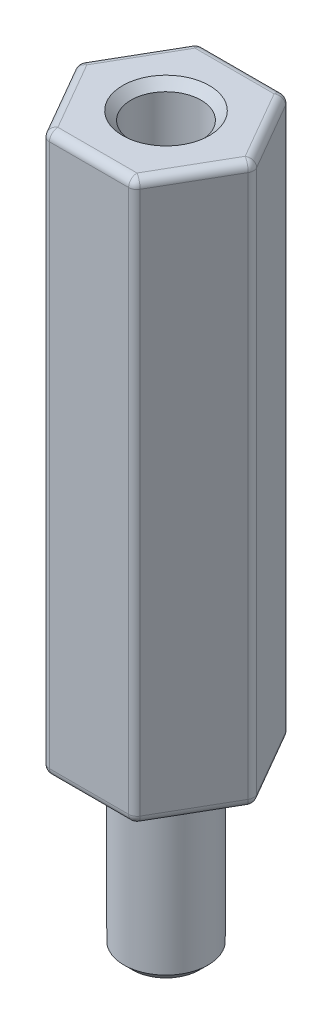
ISO-10303-21;
HEADER;
FILE_DESCRIPTION(('STEP AP214'),'2;1');
FILE_NAME('part.step','',(''),(''),'','','');
FILE_SCHEMA(('AUTOMOTIVE_DESIGN { 1 0 10303 214 1 1 1 1 }'));
ENDSEC;
DATA;
#1=APPLICATION_CONTEXT('core data for automotive mechanical design processes');
#2=APPLICATION_PROTOCOL_DEFINITION('international standard','automotive_design',2000,#1);
#3=PRODUCT_CONTEXT('',#1,'mechanical');
#4=PRODUCT('Part','Part','',(#3));
#5=PRODUCT_RELATED_PRODUCT_CATEGORY('part','',(#4));
#6=PRODUCT_DEFINITION_FORMATION('','',#4);
#7=PRODUCT_DEFINITION_CONTEXT('part definition',#1,'design');
#8=PRODUCT_DEFINITION('design','',#6,#7);
#9=PRODUCT_DEFINITION_SHAPE('','',#8);
#10=(LENGTH_UNIT() NAMED_UNIT(*) SI_UNIT(.MILLI.,.METRE.));
#11=(NAMED_UNIT(*) PLANE_ANGLE_UNIT() SI_UNIT($,.RADIAN.));
#12=(NAMED_UNIT(*) SI_UNIT($,.STERADIAN.) SOLID_ANGLE_UNIT());
#13=UNCERTAINTY_MEASURE_WITH_UNIT(LENGTH_MEASURE(1.E-05),#10,'distance_accuracy_value','');
#14=(GEOMETRIC_REPRESENTATION_CONTEXT(3) GLOBAL_UNCERTAINTY_ASSIGNED_CONTEXT((#13)) GLOBAL_UNIT_ASSIGNED_CONTEXT((#10,
#11,#12)) REPRESENTATION_CONTEXT('',''));
#15=CARTESIAN_POINT('',(0.,0.,0.));
#16=DIRECTION('',(0.,0.,1.));
#17=DIRECTION('',(1.,0.,0.));
#18=AXIS2_PLACEMENT_3D('',#15,#16,#17);
#19=CARTESIAN_POINT('',(0.,20.,0.));
#20=DIRECTION('',(0.,1.,0.));
#21=DIRECTION('',(0.,0.,1.));
#22=AXIS2_PLACEMENT_3D('',#19,#20,#21);
#23=PLANE('',#22);
#24=CARTESIAN_POINT('',(0.,20.,0.));
#25=DIRECTION('',(0.,1.,0.));
#26=DIRECTION('',(0.,0.,1.));
#27=AXIS2_PLACEMENT_3D('',#24,#25,#26);
#28=CIRCLE('',#27,1.55);
#29=CARTESIAN_POINT('',(0.,20.,1.55));
#30=VERTEX_POINT('',#29);
#31=EDGE_CURVE('E319',#30,#30,#28,.F.);
#32=ORIENTED_EDGE('',*,*,#31,.T.);
#33=EDGE_LOOP('',(#32));
#34=FACE_BOUND('',#33,.T.);
#35=DIRECTION('',(-0.5,0.,0.866025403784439));
#36=VECTOR('',#35,1.);
#37=CARTESIAN_POINT('',(-2.82901631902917,20.,0.));
#38=LINE('',#37,#36);
#39=CARTESIAN_POINT('',(-1.41450815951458,20.,-2.45));
#40=VERTEX_POINT('',#39);
#41=CARTESIAN_POINT('',(-2.82901631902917,20.,0.));
#42=VERTEX_POINT('',#41);
#43=EDGE_CURVE('E63',#40,#42,#38,.T.);
#44=ORIENTED_EDGE('',*,*,#43,.T.);
#45=DIRECTION('',(0.5,0.,0.866025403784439));
#46=VECTOR('',#45,1.);
#47=CARTESIAN_POINT('',(-1.41450815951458,20.,2.45));
#48=LINE('',#47,#46);
#49=CARTESIAN_POINT('',(-1.41450815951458,20.,2.45));
#50=VERTEX_POINT('',#49);
#51=EDGE_CURVE('E646',#42,#50,#48,.T.);
#52=ORIENTED_EDGE('',*,*,#51,.T.);
#53=DIRECTION('',(1.,0.,0.));
#54=VECTOR('',#53,1.);
#55=CARTESIAN_POINT('',(1.41450815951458,20.,2.45));
#56=LINE('',#55,#54);
#57=CARTESIAN_POINT('',(1.41450815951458,20.,2.45));
#58=VERTEX_POINT('',#57);
#59=EDGE_CURVE('E633',#50,#58,#56,.T.);
#60=ORIENTED_EDGE('',*,*,#59,.T.);
#61=DIRECTION('',(0.5,0.,-0.866025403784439));
#62=VECTOR('',#61,1.);
#63=CARTESIAN_POINT('',(2.82901631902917,20.,0.));
#64=LINE('',#63,#62);
#65=CARTESIAN_POINT('',(2.82901631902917,20.,0.));
#66=VERTEX_POINT('',#65);
#67=EDGE_CURVE('E636',#58,#66,#64,.T.);
#68=ORIENTED_EDGE('',*,*,#67,.T.);
#69=DIRECTION('',(-0.5,0.,-0.866025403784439));
#70=VECTOR('',#69,1.);
#71=CARTESIAN_POINT('',(1.41450815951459,20.,-2.45));
#72=LINE('',#71,#70);
#73=CARTESIAN_POINT('',(1.41450815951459,20.,-2.45));
#74=VERTEX_POINT('',#73);
#75=EDGE_CURVE('E639',#66,#74,#72,.T.);
#76=ORIENTED_EDGE('',*,*,#75,.T.);
#77=DIRECTION('',(-1.,0.,0.));
#78=VECTOR('',#77,1.);
#79=CARTESIAN_POINT('',(-1.41450815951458,20.,-2.45));
#80=LINE('',#79,#78);
#81=EDGE_CURVE('E68',#74,#40,#80,.T.);
#82=ORIENTED_EDGE('',*,*,#81,.T.);
#83=EDGE_LOOP('',(#44,#52,#60,#68,#76,#82));
#84=FACE_BOUND('',#83,.T.);
#85=ADVANCED_FACE('F47',(#34,#84),#23,.T.);
#86=CARTESIAN_POINT('',(0.,0.,0.));
#87=DIRECTION('',(0.,1.,0.));
#88=DIRECTION('',(0.,0.,1.));
#89=AXIS2_PLACEMENT_3D('',#86,#87,#88);
#90=PLANE('',#89);
#91=CARTESIAN_POINT('',(0.,0.,0.));
#92=DIRECTION('',(0.,1.,0.));
#93=DIRECTION('',(0.,0.,1.));
#94=AXIS2_PLACEMENT_3D('',#91,#92,#93);
#95=CIRCLE('',#94,1.8);
#96=CARTESIAN_POINT('',(0.,0.,1.8));
#97=VERTEX_POINT('',#96);
#98=EDGE_CURVE('E11',#97,#97,#95,.T.);
#99=ORIENTED_EDGE('',*,*,#98,.T.);
#100=EDGE_LOOP('',(#99));
#101=FACE_BOUND('',#100,.T.);
#102=DIRECTION('',(1.,0.,0.));
#103=VECTOR('',#102,1.);
#104=CARTESIAN_POINT('',(0.,0.,2.45));
#105=LINE('',#104,#103);
#106=CARTESIAN_POINT('',(1.41450815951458,0.,2.45));
#107=VERTEX_POINT('',#106);
#108=CARTESIAN_POINT('',(-1.41450815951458,0.,2.45));
#109=VERTEX_POINT('',#108);
#110=EDGE_CURVE('E184',#107,#109,#105,.F.);
#111=ORIENTED_EDGE('',*,*,#110,.T.);
#112=DIRECTION('',(0.5,0.,0.866025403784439));
#113=VECTOR('',#112,1.);
#114=CARTESIAN_POINT('',(-2.12176223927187,0.,1.225));
#115=LINE('',#114,#113);
#116=CARTESIAN_POINT('',(-2.82901631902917,0.,0.));
#117=VERTEX_POINT('',#116);
#118=EDGE_CURVE('E212',#109,#117,#115,.F.);
#119=ORIENTED_EDGE('',*,*,#118,.T.);
#120=DIRECTION('',(-0.5,0.,0.866025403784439));
#121=VECTOR('',#120,1.);
#122=CARTESIAN_POINT('',(-2.12176223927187,0.,-1.225));
#123=LINE('',#122,#121);
#124=CARTESIAN_POINT('',(-1.41450815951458,0.,-2.45));
#125=VERTEX_POINT('',#124);
#126=EDGE_CURVE('E574',#117,#125,#123,.F.);
#127=ORIENTED_EDGE('',*,*,#126,.T.);
#128=DIRECTION('',(-1.,0.,0.));
#129=VECTOR('',#128,1.);
#130=CARTESIAN_POINT('',(0.,0.,-2.45));
#131=LINE('',#130,#129);
#132=CARTESIAN_POINT('',(1.41450815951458,0.,-2.45));
#133=VERTEX_POINT('',#132);
#134=EDGE_CURVE('E571',#125,#133,#131,.F.);
#135=ORIENTED_EDGE('',*,*,#134,.T.);
#136=DIRECTION('',(-0.5,0.,-0.866025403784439));
#137=VECTOR('',#136,1.);
#138=CARTESIAN_POINT('',(2.12176223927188,0.,-1.225));
#139=LINE('',#138,#137);
#140=CARTESIAN_POINT('',(2.82901631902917,0.,0.));
#141=VERTEX_POINT('',#140);
#142=EDGE_CURVE('E568',#133,#141,#139,.F.);
#143=ORIENTED_EDGE('',*,*,#142,.T.);
#144=DIRECTION('',(0.5,0.,-0.866025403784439));
#145=VECTOR('',#144,1.);
#146=CARTESIAN_POINT('',(2.12176223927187,0.,1.225));
#147=LINE('',#146,#145);
#148=EDGE_CURVE('E565',#141,#107,#147,.F.);
#149=ORIENTED_EDGE('',*,*,#148,.T.);
#150=EDGE_LOOP('',(#111,#119,#127,#135,#143,#149));
#151=FACE_BOUND('',#150,.T.);
#152=ADVANCED_FACE('F339',(#101,#151),#90,.F.);
#153=CARTESIAN_POINT('',(1.58771324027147,20.,-2.75));
#154=DIRECTION('',(0.,0.,1.));
#155=DIRECTION('',(1.,0.,0.));
#156=AXIS2_PLACEMENT_3D('',#153,#154,#155);
#157=PLANE('',#156);
#158=DIRECTION('',(0.,-1.,0.));
#159=VECTOR('',#158,1.);
#160=CARTESIAN_POINT('',(1.41450815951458,20.,-2.75));
#161=LINE('',#160,#159);
#162=CARTESIAN_POINT('',(1.41450815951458,19.7,-2.75));
#163=VERTEX_POINT('',#162);
#164=CARTESIAN_POINT('',(1.41450815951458,0.300000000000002,-2.75));
#165=VERTEX_POINT('',#164);
#166=EDGE_CURVE('E521',#163,#165,#161,.T.);
#167=ORIENTED_EDGE('',*,*,#166,.T.);
#168=DIRECTION('',(-1.,0.,0.));
#169=VECTOR('',#168,1.);
#170=CARTESIAN_POINT('',(1.58771324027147,0.300000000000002,-2.75));
#171=LINE('',#170,#169);
#172=CARTESIAN_POINT('',(-1.41450815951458,0.300000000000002,-2.75));
#173=VERTEX_POINT('',#172);
#174=EDGE_CURVE('E600',#165,#173,#171,.T.);
#175=ORIENTED_EDGE('',*,*,#174,.T.);
#176=DIRECTION('',(0.,-1.,0.));
#177=VECTOR('',#176,1.);
#178=CARTESIAN_POINT('',(-1.41450815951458,20.,-2.75));
#179=LINE('',#178,#177);
#180=CARTESIAN_POINT('',(-1.41450815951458,19.7,-2.75));
#181=VERTEX_POINT('',#180);
#182=EDGE_CURVE('E517',#173,#181,#179,.F.);
#183=ORIENTED_EDGE('',*,*,#182,.T.);
#184=DIRECTION('',(-1.,0.,0.));
#185=VECTOR('',#184,1.);
#186=CARTESIAN_POINT('',(1.41450815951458,19.7,-2.75));
#187=LINE('',#186,#185);
#188=EDGE_CURVE('E597',#181,#163,#187,.F.);
#189=ORIENTED_EDGE('',*,*,#188,.T.);
#190=EDGE_LOOP('',(#167,#175,#183,#189));
#191=FACE_BOUND('',#190,.T.);
#192=ADVANCED_FACE('F345',(#191),#157,.F.);
#193=CARTESIAN_POINT('',(-1.58771324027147,20.,-2.75));
#194=DIRECTION('',(0.866025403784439,0.,0.5));
#195=DIRECTION('',(0.5,0.,-0.866025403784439));
#196=AXIS2_PLACEMENT_3D('',#193,#194,#195);
#197=PLANE('',#196);
#198=DIRECTION('',(0.,-1.,0.));
#199=VECTOR('',#198,1.);
#200=CARTESIAN_POINT('',(-1.67431578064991,20.,-2.6));
#201=LINE('',#200,#199);
#202=CARTESIAN_POINT('',(-1.67431578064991,19.7,-2.6));
#203=VERTEX_POINT('',#202);
#204=CARTESIAN_POINT('',(-1.67431578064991,0.300000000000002,-2.6));
#205=VERTEX_POINT('',#204);
#206=EDGE_CURVE('E198',#203,#205,#201,.T.);
#207=ORIENTED_EDGE('',*,*,#206,.T.);
#208=DIRECTION('',(-0.5,0.,0.866025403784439));
#209=VECTOR('',#208,1.);
#210=CARTESIAN_POINT('',(-1.58771324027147,0.300000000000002,-2.75));
#211=LINE('',#210,#209);
#212=CARTESIAN_POINT('',(-3.0888239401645,0.300000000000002,-0.15));
#213=VERTEX_POINT('',#212);
#214=EDGE_CURVE('E588',#205,#213,#211,.T.);
#215=ORIENTED_EDGE('',*,*,#214,.T.);
#216=DIRECTION('',(0.,-1.,0.));
#217=VECTOR('',#216,1.);
#218=CARTESIAN_POINT('',(-3.0888239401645,20.,-0.15));
#219=LINE('',#218,#217);
#220=CARTESIAN_POINT('',(-3.0888239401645,19.7,-0.15));
#221=VERTEX_POINT('',#220);
#222=EDGE_CURVE('E543',#213,#221,#219,.F.);
#223=ORIENTED_EDGE('',*,*,#222,.T.);
#224=DIRECTION('',(-0.5,0.,0.866025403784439));
#225=VECTOR('',#224,1.);
#226=CARTESIAN_POINT('',(-1.67431578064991,19.7,-2.6));
#227=LINE('',#226,#225);
#228=EDGE_CURVE('E585',#221,#203,#227,.F.);
#229=ORIENTED_EDGE('',*,*,#228,.T.);
#230=EDGE_LOOP('',(#207,#215,#223,#229));
#231=FACE_BOUND('',#230,.T.);
#232=ADVANCED_FACE('F366',(#231),#197,.F.);
#233=CARTESIAN_POINT('',(-3.17542648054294,20.,0.));
#234=DIRECTION('',(0.866025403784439,0.,-0.5));
#235=DIRECTION('',(-0.5,0.,-0.866025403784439));
#236=AXIS2_PLACEMENT_3D('',#233,#234,#235);
#237=PLANE('',#236);
#238=DIRECTION('',(0.,-1.,0.));
#239=VECTOR('',#238,1.);
#240=CARTESIAN_POINT('',(-3.0888239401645,20.,0.149999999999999));
#241=LINE('',#240,#239);
#242=CARTESIAN_POINT('',(-3.0888239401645,19.7,0.149999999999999));
#243=VERTEX_POINT('',#242);
#244=CARTESIAN_POINT('',(-3.0888239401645,0.300000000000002,0.149999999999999));
#245=VERTEX_POINT('',#244);
#246=EDGE_CURVE('E179',#243,#245,#241,.T.);
#247=ORIENTED_EDGE('',*,*,#246,.T.);
#248=DIRECTION('',(0.5,0.,0.866025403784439));
#249=VECTOR('',#248,1.);
#250=CARTESIAN_POINT('',(-3.17542648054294,0.300000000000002,0.));
#251=LINE('',#250,#249);
#252=CARTESIAN_POINT('',(-1.67431578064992,0.300000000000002,2.6));
#253=VERTEX_POINT('',#252);
#254=EDGE_CURVE('E174',#245,#253,#251,.T.);
#255=ORIENTED_EDGE('',*,*,#254,.T.);
#256=DIRECTION('',(0.,-1.,0.));
#257=VECTOR('',#256,1.);
#258=CARTESIAN_POINT('',(-1.67431578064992,20.,2.6));
#259=LINE('',#258,#257);
#260=CARTESIAN_POINT('',(-1.67431578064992,19.7,2.6));
#261=VERTEX_POINT('',#260);
#262=EDGE_CURVE('E177',#253,#261,#259,.F.);
#263=ORIENTED_EDGE('',*,*,#262,.T.);
#264=DIRECTION('',(0.5,0.,0.866025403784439));
#265=VECTOR('',#264,1.);
#266=CARTESIAN_POINT('',(-3.0888239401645,19.7,0.149999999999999));
#267=LINE('',#266,#265);
#268=EDGE_CURVE('E185',#261,#243,#267,.F.);
#269=ORIENTED_EDGE('',*,*,#268,.T.);
#270=EDGE_LOOP('',(#247,#255,#263,#269));
#271=FACE_BOUND('',#270,.T.);
#272=ADVANCED_FACE('F176',(#271),#237,.F.);
#273=CARTESIAN_POINT('',(-1.58771324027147,20.,2.75));
#274=DIRECTION('',(0.,0.,-1.));
#275=DIRECTION('',(-1.,0.,0.));
#276=AXIS2_PLACEMENT_3D('',#273,#274,#275);
#277=PLANE('',#276);
#278=DIRECTION('',(0.,-1.,0.));
#279=VECTOR('',#278,1.);
#280=CARTESIAN_POINT('',(-1.41450815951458,20.,2.75));
#281=LINE('',#280,#279);
#282=CARTESIAN_POINT('',(-1.41450815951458,19.7,2.75));
#283=VERTEX_POINT('',#282);
#284=CARTESIAN_POINT('',(-1.41450815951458,0.300000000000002,2.75));
#285=VERTEX_POINT('',#284);
#286=EDGE_CURVE('E556',#283,#285,#281,.T.);
#287=ORIENTED_EDGE('',*,*,#286,.T.);
#288=DIRECTION('',(1.,0.,0.));
#289=VECTOR('',#288,1.);
#290=CARTESIAN_POINT('',(-1.58771324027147,0.300000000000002,2.75));
#291=LINE('',#290,#289);
#292=CARTESIAN_POINT('',(1.41450815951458,0.300000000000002,2.75));
#293=VERTEX_POINT('',#292);
#294=EDGE_CURVE('E224',#285,#293,#291,.T.);
#295=ORIENTED_EDGE('',*,*,#294,.T.);
#296=DIRECTION('',(0.,-1.,0.));
#297=VECTOR('',#296,1.);
#298=CARTESIAN_POINT('',(1.41450815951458,20.,2.75));
#299=LINE('',#298,#297);
#300=CARTESIAN_POINT('',(1.41450815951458,19.7,2.75));
#301=VERTEX_POINT('',#300);
#302=EDGE_CURVE('E552',#293,#301,#299,.F.);
#303=ORIENTED_EDGE('',*,*,#302,.T.);
#304=DIRECTION('',(1.,0.,0.));
#305=VECTOR('',#304,1.);
#306=CARTESIAN_POINT('',(-1.41450815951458,19.7,2.75));
#307=LINE('',#306,#305);
#308=EDGE_CURVE('E648',#301,#283,#307,.F.);
#309=ORIENTED_EDGE('',*,*,#308,.T.);
#310=EDGE_LOOP('',(#287,#295,#303,#309));
#311=FACE_BOUND('',#310,.T.);
#312=ADVANCED_FACE('F359',(#311),#277,.F.);
#313=CARTESIAN_POINT('',(1.58771324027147,20.,2.75));
#314=DIRECTION('',(-0.866025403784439,0.,-0.5));
#315=DIRECTION('',(-0.5,0.,0.866025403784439));
#316=AXIS2_PLACEMENT_3D('',#313,#314,#315);
#317=PLANE('',#316);
#318=DIRECTION('',(0.,-1.,0.));
#319=VECTOR('',#318,1.);
#320=CARTESIAN_POINT('',(1.67431578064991,20.,2.6));
#321=LINE('',#320,#319);
#322=CARTESIAN_POINT('',(1.67431578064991,19.7,2.6));
#323=VERTEX_POINT('',#322);
#324=CARTESIAN_POINT('',(1.67431578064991,0.300000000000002,2.6));
#325=VERTEX_POINT('',#324);
#326=EDGE_CURVE('E535',#323,#325,#321,.T.);
#327=ORIENTED_EDGE('',*,*,#326,.T.);
#328=DIRECTION('',(0.5,0.,-0.866025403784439));
#329=VECTOR('',#328,1.);
#330=CARTESIAN_POINT('',(1.58771324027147,0.300000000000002,2.75));
#331=LINE('',#330,#329);
#332=CARTESIAN_POINT('',(3.0888239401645,0.300000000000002,0.149999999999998));
#333=VERTEX_POINT('',#332);
#334=EDGE_CURVE('E624',#325,#333,#331,.T.);
#335=ORIENTED_EDGE('',*,*,#334,.T.);
#336=DIRECTION('',(0.,-1.,0.));
#337=VECTOR('',#336,1.);
#338=CARTESIAN_POINT('',(3.0888239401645,20.,0.149999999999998));
#339=LINE('',#338,#337);
#340=CARTESIAN_POINT('',(3.0888239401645,19.7,0.149999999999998));
#341=VERTEX_POINT('',#340);
#342=EDGE_CURVE('E539',#333,#341,#339,.F.);
#343=ORIENTED_EDGE('',*,*,#342,.T.);
#344=DIRECTION('',(0.5,0.,-0.866025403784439));
#345=VECTOR('',#344,1.);
#346=CARTESIAN_POINT('',(1.67431578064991,19.7,2.6));
#347=LINE('',#346,#345);
#348=EDGE_CURVE('E621',#341,#323,#347,.F.);
#349=ORIENTED_EDGE('',*,*,#348,.T.);
#350=EDGE_LOOP('',(#327,#335,#343,#349));
#351=FACE_BOUND('',#350,.T.);
#352=ADVANCED_FACE('F355',(#351),#317,.F.);
#353=CARTESIAN_POINT('',(3.17542648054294,20.,0.));
#354=DIRECTION('',(-0.866025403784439,0.,0.5));
#355=DIRECTION('',(0.5,0.,0.866025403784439));
#356=AXIS2_PLACEMENT_3D('',#353,#354,#355);
#357=PLANE('',#356);
#358=DIRECTION('',(0.,-1.,0.));
#359=VECTOR('',#358,1.);
#360=CARTESIAN_POINT('',(3.0888239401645,20.,-0.150000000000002));
#361=LINE('',#360,#359);
#362=CARTESIAN_POINT('',(3.0888239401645,19.7,-0.150000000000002));
#363=VERTEX_POINT('',#362);
#364=CARTESIAN_POINT('',(3.0888239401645,0.300000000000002,-0.150000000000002));
#365=VERTEX_POINT('',#364);
#366=EDGE_CURVE('E527',#363,#365,#361,.T.);
#367=ORIENTED_EDGE('',*,*,#366,.T.);
#368=DIRECTION('',(-0.5,0.,-0.866025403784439));
#369=VECTOR('',#368,1.);
#370=CARTESIAN_POINT('',(3.17542648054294,0.300000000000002,0.));
#371=LINE('',#370,#369);
#372=CARTESIAN_POINT('',(1.67431578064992,0.300000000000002,-2.6));
#373=VERTEX_POINT('',#372);
#374=EDGE_CURVE('E612',#365,#373,#371,.T.);
#375=ORIENTED_EDGE('',*,*,#374,.T.);
#376=DIRECTION('',(0.,-1.,0.));
#377=VECTOR('',#376,1.);
#378=CARTESIAN_POINT('',(1.67431578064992,20.,-2.6));
#379=LINE('',#378,#377);
#380=CARTESIAN_POINT('',(1.67431578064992,19.7,-2.6));
#381=VERTEX_POINT('',#380);
#382=EDGE_CURVE('E531',#373,#381,#379,.F.);
#383=ORIENTED_EDGE('',*,*,#382,.T.);
#384=DIRECTION('',(-0.5,0.,-0.866025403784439));
#385=VECTOR('',#384,1.);
#386=CARTESIAN_POINT('',(3.0888239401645,19.7,-0.150000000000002));
#387=LINE('',#386,#385);
#388=EDGE_CURVE('E609',#381,#363,#387,.F.);
#389=ORIENTED_EDGE('',*,*,#388,.T.);
#390=EDGE_LOOP('',(#367,#375,#383,#389));
#391=FACE_BOUND('',#390,.T.);
#392=ADVANCED_FACE('F352',(#391),#357,.F.);
#393=CARTESIAN_POINT('',(0.,20.,0.));
#394=DIRECTION('',(0.,-1.,0.));
#395=DIRECTION('',(0.,0.,-1.));
#396=AXIS2_PLACEMENT_3D('',#393,#394,#395);
#397=CYLINDRICAL_SURFACE('',#396,1.25);
#398=CARTESIAN_POINT('',(0.,19.7,0.));
#399=DIRECTION('',(0.,1.,0.));
#400=DIRECTION('',(0.,0.,1.));
#401=AXIS2_PLACEMENT_3D('',#398,#399,#400);
#402=CIRCLE('',#401,1.25);
#403=CARTESIAN_POINT('',(0.,19.7,1.25));
#404=VERTEX_POINT('',#403);
#405=EDGE_CURVE('E315',#404,#404,#402,.T.);
#406=ORIENTED_EDGE('',*,*,#405,.T.);
#407=EDGE_LOOP('',(#406));
#408=FACE_BOUND('',#407,.T.);
#409=CARTESIAN_POINT('',(0.,0.,0.));
#410=DIRECTION('',(0.,1.,0.));
#411=DIRECTION('',(0.,0.,1.));
#412=AXIS2_PLACEMENT_3D('',#409,#410,#411);
#413=CIRCLE('',#412,1.25);
#414=CARTESIAN_POINT('',(0.,0.,1.25));
#415=VERTEX_POINT('',#414);
#416=EDGE_CURVE('E265',#415,#415,#413,.T.);
#417=ORIENTED_EDGE('',*,*,#416,.F.);
#418=EDGE_LOOP('',(#417));
#419=FACE_BOUND('',#418,.T.);
#420=ADVANCED_FACE('F349',(#408,#419),#397,.F.);
#421=CARTESIAN_POINT('',(1.41450815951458,20.,-2.45));
#422=DIRECTION('',(0.,-1.,0.));
#423=DIRECTION('',(0.,0.,-1.));
#424=AXIS2_PLACEMENT_3D('',#421,#422,#423);
#425=CYLINDRICAL_SURFACE('',#424,0.3);
#426=ORIENTED_EDGE('',*,*,#382,.F.);
#427=CARTESIAN_POINT('',(1.41450815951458,0.300000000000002,-2.45));
#428=DIRECTION('',(0.,-1.,0.));
#429=DIRECTION('',(0.,0.,-1.));
#430=AXIS2_PLACEMENT_3D('',#427,#428,#429);
#431=CIRCLE('',#430,0.3);
#432=EDGE_CURVE('E606',#373,#165,#431,.F.);
#433=ORIENTED_EDGE('',*,*,#432,.T.);
#434=ORIENTED_EDGE('',*,*,#166,.F.);
#435=CARTESIAN_POINT('',(1.41450815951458,19.7,-2.45));
#436=DIRECTION('',(0.,-1.,0.));
#437=DIRECTION('',(0.,0.,-1.));
#438=AXIS2_PLACEMENT_3D('',#435,#436,#437);
#439=CIRCLE('',#438,0.3);
#440=EDGE_CURVE('E603',#163,#381,#439,.T.);
#441=ORIENTED_EDGE('',*,*,#440,.T.);
#442=EDGE_LOOP('',(#426,#433,#434,#441));
#443=FACE_BOUND('',#442,.T.);
#444=ADVANCED_FACE('F373',(#443),#425,.T.);
#445=CARTESIAN_POINT('',(2.82901631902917,20.,0.));
#446=DIRECTION('',(0.,-1.,0.));
#447=DIRECTION('',(0.,0.,-1.));
#448=AXIS2_PLACEMENT_3D('',#445,#446,#447);
#449=CYLINDRICAL_SURFACE('',#448,0.3);
#450=ORIENTED_EDGE('',*,*,#342,.F.);
#451=CARTESIAN_POINT('',(2.82901631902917,0.300000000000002,0.));
#452=DIRECTION('',(0.,-1.,0.));
#453=DIRECTION('',(0.,0.,-1.));
#454=AXIS2_PLACEMENT_3D('',#451,#452,#453);
#455=CIRCLE('',#454,0.3);
#456=EDGE_CURVE('E618',#333,#365,#455,.F.);
#457=ORIENTED_EDGE('',*,*,#456,.T.);
#458=ORIENTED_EDGE('',*,*,#366,.F.);
#459=CARTESIAN_POINT('',(2.82901631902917,19.7,0.));
#460=DIRECTION('',(0.,-1.,0.));
#461=DIRECTION('',(0.,0.,-1.));
#462=AXIS2_PLACEMENT_3D('',#459,#460,#461);
#463=CIRCLE('',#462,0.3);
#464=EDGE_CURVE('E615',#363,#341,#463,.T.);
#465=ORIENTED_EDGE('',*,*,#464,.T.);
#466=EDGE_LOOP('',(#450,#457,#458,#465));
#467=FACE_BOUND('',#466,.T.);
#468=ADVANCED_FACE('F376',(#467),#449,.T.);
#469=CARTESIAN_POINT('',(-1.41450815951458,20.,-2.45));
#470=DIRECTION('',(0.,-1.,0.));
#471=DIRECTION('',(0.,0.,-1.));
#472=AXIS2_PLACEMENT_3D('',#469,#470,#471);
#473=CYLINDRICAL_SURFACE('',#472,0.3);
#474=ORIENTED_EDGE('',*,*,#182,.F.);
#475=CARTESIAN_POINT('',(-1.41450815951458,0.300000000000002,-2.45));
#476=DIRECTION('',(0.,-1.,0.));
#477=DIRECTION('',(0.,0.,-1.));
#478=AXIS2_PLACEMENT_3D('',#475,#476,#477);
#479=CIRCLE('',#478,0.3);
#480=EDGE_CURVE('E594',#173,#205,#479,.F.);
#481=ORIENTED_EDGE('',*,*,#480,.T.);
#482=ORIENTED_EDGE('',*,*,#206,.F.);
#483=CARTESIAN_POINT('',(-1.41450815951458,19.7,-2.45));
#484=DIRECTION('',(0.,-1.,0.));
#485=DIRECTION('',(0.,0.,-1.));
#486=AXIS2_PLACEMENT_3D('',#483,#484,#485);
#487=CIRCLE('',#486,0.3);
#488=EDGE_CURVE('E591',#203,#181,#487,.T.);
#489=ORIENTED_EDGE('',*,*,#488,.T.);
#490=EDGE_LOOP('',(#474,#481,#482,#489));
#491=FACE_BOUND('',#490,.T.);
#492=ADVANCED_FACE('F380',(#491),#473,.T.);
#493=CARTESIAN_POINT('',(-2.82901631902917,20.,0.));
#494=DIRECTION('',(0.,-1.,0.));
#495=DIRECTION('',(0.,0.,-1.));
#496=AXIS2_PLACEMENT_3D('',#493,#494,#495);
#497=CYLINDRICAL_SURFACE('',#496,0.3);
#498=ORIENTED_EDGE('',*,*,#222,.F.);
#499=CARTESIAN_POINT('',(-2.82901631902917,0.300000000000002,0.));
#500=DIRECTION('',(0.,-1.,0.));
#501=DIRECTION('',(0.,0.,-1.));
#502=AXIS2_PLACEMENT_3D('',#499,#500,#501);
#503=CIRCLE('',#502,0.3);
#504=EDGE_CURVE('E582',#213,#245,#503,.F.);
#505=ORIENTED_EDGE('',*,*,#504,.T.);
#506=ORIENTED_EDGE('',*,*,#246,.F.);
#507=CARTESIAN_POINT('',(-2.82901631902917,19.7,0.));
#508=DIRECTION('',(0.,-1.,0.));
#509=DIRECTION('',(0.,0.,-1.));
#510=AXIS2_PLACEMENT_3D('',#507,#508,#509);
#511=CIRCLE('',#510,0.3);
#512=EDGE_CURVE('E579',#243,#221,#511,.T.);
#513=ORIENTED_EDGE('',*,*,#512,.T.);
#514=EDGE_LOOP('',(#498,#505,#506,#513));
#515=FACE_BOUND('',#514,.T.);
#516=ADVANCED_FACE('F384',(#515),#497,.T.);
#517=CARTESIAN_POINT('',(-1.41450815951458,20.,2.45));
#518=DIRECTION('',(0.,-1.,0.));
#519=DIRECTION('',(0.,0.,-1.));
#520=AXIS2_PLACEMENT_3D('',#517,#518,#519);
#521=CYLINDRICAL_SURFACE('',#520,0.3);
#522=ORIENTED_EDGE('',*,*,#262,.F.);
#523=CARTESIAN_POINT('',(-1.41450815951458,0.300000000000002,2.45));
#524=DIRECTION('',(0.,-1.,0.));
#525=DIRECTION('',(0.,0.,-1.));
#526=AXIS2_PLACEMENT_3D('',#523,#524,#525);
#527=CIRCLE('',#526,0.3);
#528=EDGE_CURVE('E193',#253,#285,#527,.F.);
#529=ORIENTED_EDGE('',*,*,#528,.T.);
#530=ORIENTED_EDGE('',*,*,#286,.F.);
#531=CARTESIAN_POINT('',(-1.41450815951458,19.7,2.45));
#532=DIRECTION('',(0.,-1.,0.));
#533=DIRECTION('',(0.,0.,-1.));
#534=AXIS2_PLACEMENT_3D('',#531,#532,#533);
#535=CIRCLE('',#534,0.3);
#536=EDGE_CURVE('E196',#283,#261,#535,.T.);
#537=ORIENTED_EDGE('',*,*,#536,.T.);
#538=EDGE_LOOP('',(#522,#529,#530,#537));
#539=FACE_BOUND('',#538,.T.);
#540=ADVANCED_FACE('F191',(#539),#521,.T.);
#541=CARTESIAN_POINT('',(1.41450815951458,20.,2.45));
#542=DIRECTION('',(0.,-1.,0.));
#543=DIRECTION('',(0.,0.,-1.));
#544=AXIS2_PLACEMENT_3D('',#541,#542,#543);
#545=CYLINDRICAL_SURFACE('',#544,0.3);
#546=ORIENTED_EDGE('',*,*,#302,.F.);
#547=CARTESIAN_POINT('',(1.41450815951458,0.300000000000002,2.45));
#548=DIRECTION('',(0.,-1.,0.));
#549=DIRECTION('',(0.,0.,-1.));
#550=AXIS2_PLACEMENT_3D('',#547,#548,#549);
#551=CIRCLE('',#550,0.3);
#552=EDGE_CURVE('E630',#293,#325,#551,.F.);
#553=ORIENTED_EDGE('',*,*,#552,.T.);
#554=ORIENTED_EDGE('',*,*,#326,.F.);
#555=CARTESIAN_POINT('',(1.41450815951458,19.7,2.45));
#556=DIRECTION('',(0.,-1.,0.));
#557=DIRECTION('',(0.,0.,-1.));
#558=AXIS2_PLACEMENT_3D('',#555,#556,#557);
#559=CIRCLE('',#558,0.3);
#560=EDGE_CURVE('E627',#323,#301,#559,.T.);
#561=ORIENTED_EDGE('',*,*,#560,.T.);
#562=EDGE_LOOP('',(#546,#553,#554,#561));
#563=FACE_BOUND('',#562,.T.);
#564=ADVANCED_FACE('F391',(#563),#545,.T.);
#565=CARTESIAN_POINT('',(1.41450815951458,0.300000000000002,-2.45));
#566=DIRECTION('',(0.,1.,0.));
#567=DIRECTION('',(0.,0.,1.));
#568=AXIS2_PLACEMENT_3D('',#565,#566,#567);
#569=SPHERICAL_SURFACE('',#568,0.3);
#570=CARTESIAN_POINT('',(1.41450815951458,0.300000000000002,-2.45));
#571=DIRECTION('',(-1.,0.,0.));
#572=DIRECTION('',(0.,0.,1.));
#573=AXIS2_PLACEMENT_3D('',#570,#571,#572);
#574=CIRCLE('',#573,0.3);
#575=EDGE_CURVE('E257',#165,#133,#574,.T.);
#576=ORIENTED_EDGE('',*,*,#575,.F.);
#577=ORIENTED_EDGE('',*,*,#432,.F.);
#578=CARTESIAN_POINT('',(1.41450815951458,0.300000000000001,-2.45));
#579=DIRECTION('',(0.499999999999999,0.,0.866025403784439));
#580=DIRECTION('',(0.866025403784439,0.,-0.499999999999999));
#581=AXIS2_PLACEMENT_3D('',#578,#579,#580);
#582=CIRCLE('',#581,0.3);
#583=EDGE_CURVE('E261',#133,#373,#582,.T.);
#584=ORIENTED_EDGE('',*,*,#583,.F.);
#585=EDGE_LOOP('',(#576,#577,#584));
#586=FACE_BOUND('',#585,.T.);
#587=ADVANCED_FACE('F394',(#586),#569,.T.);
#588=CARTESIAN_POINT('',(2.91561885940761,0.300000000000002,0.149999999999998));
#589=DIRECTION('',(-0.5,0.,-0.866025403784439));
#590=DIRECTION('',(-0.866025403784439,0.,0.5));
#591=AXIS2_PLACEMENT_3D('',#588,#589,#590);
#592=CYLINDRICAL_SURFACE('',#591,0.3);
#593=ORIENTED_EDGE('',*,*,#583,.T.);
#594=ORIENTED_EDGE('',*,*,#374,.F.);
#595=CARTESIAN_POINT('',(2.82901631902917,0.3,0.));
#596=DIRECTION('',(0.5,0.,0.866025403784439));
#597=DIRECTION('',(0.866025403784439,0.,-0.5));
#598=AXIS2_PLACEMENT_3D('',#595,#596,#597);
#599=CIRCLE('',#598,0.3);
#600=EDGE_CURVE('E253',#141,#365,#599,.T.);
#601=ORIENTED_EDGE('',*,*,#600,.F.);
#602=ORIENTED_EDGE('',*,*,#142,.F.);
#603=EDGE_LOOP('',(#593,#594,#601,#602));
#604=FACE_BOUND('',#603,.T.);
#605=ADVANCED_FACE('F432',(#604),#592,.T.);
#606=CARTESIAN_POINT('',(1.58771324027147,0.300000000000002,-2.45));
#607=DIRECTION('',(-1.,0.,0.));
#608=DIRECTION('',(0.,0.,1.));
#609=AXIS2_PLACEMENT_3D('',#606,#607,#608);
#610=CYLINDRICAL_SURFACE('',#609,0.3);
#611=ORIENTED_EDGE('',*,*,#575,.T.);
#612=ORIENTED_EDGE('',*,*,#134,.F.);
#613=CARTESIAN_POINT('',(-1.41450815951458,0.300000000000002,-2.45));
#614=DIRECTION('',(-1.,0.,0.));
#615=DIRECTION('',(0.,-1.,0.));
#616=AXIS2_PLACEMENT_3D('',#613,#614,#615);
#617=CIRCLE('',#616,0.3);
#618=EDGE_CURVE('E249',#173,#125,#617,.T.);
#619=ORIENTED_EDGE('',*,*,#618,.F.);
#620=ORIENTED_EDGE('',*,*,#174,.F.);
#621=EDGE_LOOP('',(#611,#612,#619,#620));
#622=FACE_BOUND('',#621,.T.);
#623=ADVANCED_FACE('F428',(#622),#610,.T.);
#624=CARTESIAN_POINT('',(2.82901631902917,0.300000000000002,0.));
#625=DIRECTION('',(0.,1.,0.));
#626=DIRECTION('',(0.,0.,1.));
#627=AXIS2_PLACEMENT_3D('',#624,#625,#626);
#628=SPHERICAL_SURFACE('',#627,0.3);
#629=ORIENTED_EDGE('',*,*,#600,.T.);
#630=ORIENTED_EDGE('',*,*,#456,.F.);
#631=CARTESIAN_POINT('',(2.82901631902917,0.300000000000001,0.));
#632=DIRECTION('',(-0.5,0.,0.866025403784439));
#633=DIRECTION('',(0.866025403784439,0.,0.5));
#634=AXIS2_PLACEMENT_3D('',#631,#632,#633);
#635=CIRCLE('',#634,0.3);
#636=EDGE_CURVE('E245',#141,#333,#635,.T.);
#637=ORIENTED_EDGE('',*,*,#636,.F.);
#638=EDGE_LOOP('',(#629,#630,#637));
#639=FACE_BOUND('',#638,.T.);
#640=ADVANCED_FACE('F424',(#639),#628,.T.);
#641=CARTESIAN_POINT('',(-1.41450815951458,0.300000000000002,-2.45));
#642=DIRECTION('',(0.,1.,0.));
#643=DIRECTION('',(0.,0.,1.));
#644=AXIS2_PLACEMENT_3D('',#641,#642,#643);
#645=SPHERICAL_SURFACE('',#644,0.3);
#646=ORIENTED_EDGE('',*,*,#480,.F.);
#647=ORIENTED_EDGE('',*,*,#618,.T.);
#648=CARTESIAN_POINT('',(-1.41450815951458,0.300000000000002,-2.45));
#649=DIRECTION('',(-0.5,0.,0.866025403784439));
#650=DIRECTION('',(0.866025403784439,0.,0.5));
#651=AXIS2_PLACEMENT_3D('',#648,#649,#650);
#652=CIRCLE('',#651,0.3);
#653=EDGE_CURVE('E241',#205,#125,#652,.T.);
#654=ORIENTED_EDGE('',*,*,#653,.F.);
#655=EDGE_LOOP('',(#646,#647,#654));
#656=FACE_BOUND('',#655,.T.);
#657=ADVANCED_FACE('F420',(#656),#645,.T.);
#658=CARTESIAN_POINT('',(1.32790561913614,0.300000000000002,2.6));
#659=DIRECTION('',(0.5,0.,-0.866025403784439));
#660=DIRECTION('',(-0.866025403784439,0.,-0.5));
#661=AXIS2_PLACEMENT_3D('',#658,#659,#660);
#662=CYLINDRICAL_SURFACE('',#661,0.3);
#663=ORIENTED_EDGE('',*,*,#636,.T.);
#664=ORIENTED_EDGE('',*,*,#334,.F.);
#665=CARTESIAN_POINT('',(1.41450815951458,0.3,2.45));
#666=DIRECTION('',(-0.5,0.,0.866025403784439));
#667=DIRECTION('',(0.866025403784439,0.,0.5));
#668=AXIS2_PLACEMENT_3D('',#665,#666,#667);
#669=CIRCLE('',#668,0.3);
#670=EDGE_CURVE('E237',#107,#325,#669,.T.);
#671=ORIENTED_EDGE('',*,*,#670,.F.);
#672=ORIENTED_EDGE('',*,*,#148,.F.);
#673=EDGE_LOOP('',(#663,#664,#671,#672));
#674=FACE_BOUND('',#673,.T.);
#675=ADVANCED_FACE('F416',(#674),#662,.T.);
#676=CARTESIAN_POINT('',(-1.32790561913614,0.300000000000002,-2.6));
#677=DIRECTION('',(-0.5,0.,0.866025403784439));
#678=DIRECTION('',(0.866025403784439,0.,0.5));
#679=AXIS2_PLACEMENT_3D('',#676,#677,#678);
#680=CYLINDRICAL_SURFACE('',#679,0.3);
#681=ORIENTED_EDGE('',*,*,#653,.T.);
#682=ORIENTED_EDGE('',*,*,#126,.F.);
#683=CARTESIAN_POINT('',(-2.82901631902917,0.300000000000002,0.));
#684=DIRECTION('',(-0.5,0.,0.866025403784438));
#685=DIRECTION('',(0.866025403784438,0.,0.5));
#686=AXIS2_PLACEMENT_3D('',#683,#684,#685);
#687=CIRCLE('',#686,0.3);
#688=EDGE_CURVE('E233',#213,#117,#687,.T.);
#689=ORIENTED_EDGE('',*,*,#688,.F.);
#690=ORIENTED_EDGE('',*,*,#214,.F.);
#691=EDGE_LOOP('',(#681,#682,#689,#690));
#692=FACE_BOUND('',#691,.T.);
#693=ADVANCED_FACE('F412',(#692),#680,.T.);
#694=CARTESIAN_POINT('',(1.41450815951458,0.300000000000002,2.45));
#695=DIRECTION('',(0.,1.,0.));
#696=DIRECTION('',(0.,0.,1.));
#697=AXIS2_PLACEMENT_3D('',#694,#695,#696);
#698=SPHERICAL_SURFACE('',#697,0.3);
#699=ORIENTED_EDGE('',*,*,#670,.T.);
#700=ORIENTED_EDGE('',*,*,#552,.F.);
#701=CARTESIAN_POINT('',(1.41450815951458,0.300000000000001,2.45));
#702=DIRECTION('',(-1.,0.,0.));
#703=DIRECTION('',(0.,0.,1.));
#704=AXIS2_PLACEMENT_3D('',#701,#702,#703);
#705=CIRCLE('',#704,0.3);
#706=EDGE_CURVE('E229',#107,#293,#705,.T.);
#707=ORIENTED_EDGE('',*,*,#706,.F.);
#708=EDGE_LOOP('',(#699,#700,#707));
#709=FACE_BOUND('',#708,.T.);
#710=ADVANCED_FACE('F408',(#709),#698,.T.);
#711=CARTESIAN_POINT('',(-2.82901631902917,0.300000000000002,0.));
#712=DIRECTION('',(0.,1.,0.));
#713=DIRECTION('',(0.,0.,1.));
#714=AXIS2_PLACEMENT_3D('',#711,#712,#713);
#715=SPHERICAL_SURFACE('',#714,0.3);
#716=ORIENTED_EDGE('',*,*,#504,.F.);
#717=ORIENTED_EDGE('',*,*,#688,.T.);
#718=CARTESIAN_POINT('',(-2.82901631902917,0.300000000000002,0.));
#719=DIRECTION('',(0.5,0.,0.866025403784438));
#720=DIRECTION('',(0.866025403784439,0.,-0.5));
#721=AXIS2_PLACEMENT_3D('',#718,#719,#720);
#722=CIRCLE('',#721,0.3);
#723=EDGE_CURVE('E218',#245,#117,#722,.T.);
#724=ORIENTED_EDGE('',*,*,#723,.F.);
#725=EDGE_LOOP('',(#716,#717,#724));
#726=FACE_BOUND('',#725,.T.);
#727=ADVANCED_FACE('F404',(#726),#715,.T.);
#728=CARTESIAN_POINT('',(-1.58771324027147,0.300000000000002,2.45));
#729=DIRECTION('',(1.,0.,0.));
#730=DIRECTION('',(0.,0.,-1.));
#731=AXIS2_PLACEMENT_3D('',#728,#729,#730);
#732=CYLINDRICAL_SURFACE('',#731,0.3);
#733=ORIENTED_EDGE('',*,*,#706,.T.);
#734=ORIENTED_EDGE('',*,*,#294,.F.);
#735=CARTESIAN_POINT('',(-1.41450815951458,0.3,2.45));
#736=DIRECTION('',(-1.,0.,0.));
#737=DIRECTION('',(0.,0.,1.));
#738=AXIS2_PLACEMENT_3D('',#735,#736,#737);
#739=CIRCLE('',#738,0.3);
#740=EDGE_CURVE('E205',#109,#285,#739,.T.);
#741=ORIENTED_EDGE('',*,*,#740,.F.);
#742=ORIENTED_EDGE('',*,*,#110,.F.);
#743=EDGE_LOOP('',(#733,#734,#741,#742));
#744=FACE_BOUND('',#743,.T.);
#745=ADVANCED_FACE('F401',(#744),#732,.T.);
#746=CARTESIAN_POINT('',(-2.91561885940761,0.300000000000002,-0.150000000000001));
#747=DIRECTION('',(0.5,0.,0.866025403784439));
#748=DIRECTION('',(0.866025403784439,0.,-0.5));
#749=AXIS2_PLACEMENT_3D('',#746,#747,#748);
#750=CYLINDRICAL_SURFACE('',#749,0.3);
#751=ORIENTED_EDGE('',*,*,#723,.T.);
#752=ORIENTED_EDGE('',*,*,#118,.F.);
#753=CARTESIAN_POINT('',(-1.41450815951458,0.300000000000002,2.45));
#754=DIRECTION('',(0.5,0.,0.866025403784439));
#755=DIRECTION('',(0.866025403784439,0.,-0.5));
#756=AXIS2_PLACEMENT_3D('',#753,#754,#755);
#757=CIRCLE('',#756,0.3);
#758=EDGE_CURVE('E203',#253,#109,#757,.T.);
#759=ORIENTED_EDGE('',*,*,#758,.F.);
#760=ORIENTED_EDGE('',*,*,#254,.F.);
#761=EDGE_LOOP('',(#751,#752,#759,#760));
#762=FACE_BOUND('',#761,.T.);
#763=ADVANCED_FACE('F210',(#762),#750,.T.);
#764=CARTESIAN_POINT('',(-1.41450815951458,0.300000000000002,2.45));
#765=DIRECTION('',(0.,1.,0.));
#766=DIRECTION('',(0.,0.,1.));
#767=AXIS2_PLACEMENT_3D('',#764,#765,#766);
#768=SPHERICAL_SURFACE('',#767,0.3);
#769=ORIENTED_EDGE('',*,*,#740,.T.);
#770=ORIENTED_EDGE('',*,*,#528,.F.);
#771=ORIENTED_EDGE('',*,*,#758,.T.);
#772=EDGE_LOOP('',(#769,#770,#771));
#773=FACE_BOUND('',#772,.T.);
#774=ADVANCED_FACE('F202',(#773),#768,.T.);
#775=CARTESIAN_POINT('',(1.41450815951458,19.7,-2.45));
#776=DIRECTION('',(0.,1.,0.));
#777=DIRECTION('',(0.,0.,1.));
#778=AXIS2_PLACEMENT_3D('',#775,#776,#777);
#779=SPHERICAL_SURFACE('',#778,0.3);
#780=CARTESIAN_POINT('',(1.41450815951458,19.7,-2.45));
#781=DIRECTION('',(0.499999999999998,0.,0.86602540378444));
#782=DIRECTION('',(0.86602540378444,0.,-0.499999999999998));
#783=AXIS2_PLACEMENT_3D('',#780,#781,#782);
#784=CIRCLE('',#783,0.3);
#785=EDGE_CURVE('E221',#381,#74,#784,.T.);
#786=ORIENTED_EDGE('',*,*,#785,.F.);
#787=ORIENTED_EDGE('',*,*,#440,.F.);
#788=CARTESIAN_POINT('',(1.41450815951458,19.7,-2.45));
#789=DIRECTION('',(-1.,0.,0.));
#790=DIRECTION('',(0.,0.,1.));
#791=AXIS2_PLACEMENT_3D('',#788,#789,#790);
#792=CIRCLE('',#791,0.3);
#793=EDGE_CURVE('E214',#74,#163,#792,.T.);
#794=ORIENTED_EDGE('',*,*,#793,.F.);
#795=EDGE_LOOP('',(#786,#787,#794));
#796=FACE_BOUND('',#795,.T.);
#797=ADVANCED_FACE('F398',(#796),#779,.T.);
#798=CARTESIAN_POINT('',(0.,19.7,-2.45));
#799=DIRECTION('',(1.,0.,0.));
#800=DIRECTION('',(0.,0.,-1.));
#801=AXIS2_PLACEMENT_3D('',#798,#799,#800);
#802=CYLINDRICAL_SURFACE('',#801,0.3);
#803=ORIENTED_EDGE('',*,*,#793,.T.);
#804=ORIENTED_EDGE('',*,*,#188,.F.);
#805=CARTESIAN_POINT('',(-1.41450815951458,19.7,-2.45));
#806=DIRECTION('',(-1.,0.,0.));
#807=DIRECTION('',(0.,0.,1.));
#808=AXIS2_PLACEMENT_3D('',#805,#806,#807);
#809=CIRCLE('',#808,0.3);
#810=EDGE_CURVE('E300',#40,#181,#809,.T.);
#811=ORIENTED_EDGE('',*,*,#810,.F.);
#812=ORIENTED_EDGE('',*,*,#81,.F.);
#813=EDGE_LOOP('',(#803,#804,#811,#812));
#814=FACE_BOUND('',#813,.T.);
#815=ADVANCED_FACE('F480',(#814),#802,.T.);
#816=CARTESIAN_POINT('',(2.12176223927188,19.7,-1.225));
#817=DIRECTION('',(0.5,0.,0.866025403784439));
#818=DIRECTION('',(0.866025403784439,0.,-0.5));
#819=AXIS2_PLACEMENT_3D('',#816,#817,#818);
#820=CYLINDRICAL_SURFACE('',#819,0.3);
#821=ORIENTED_EDGE('',*,*,#785,.T.);
#822=ORIENTED_EDGE('',*,*,#75,.F.);
#823=CARTESIAN_POINT('',(2.82901631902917,19.7,0.));
#824=DIRECTION('',(0.5,0.,0.866025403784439));
#825=DIRECTION('',(0.866025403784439,0.,-0.5));
#826=AXIS2_PLACEMENT_3D('',#823,#824,#825);
#827=CIRCLE('',#826,0.3);
#828=EDGE_CURVE('E296',#363,#66,#827,.T.);
#829=ORIENTED_EDGE('',*,*,#828,.F.);
#830=ORIENTED_EDGE('',*,*,#388,.F.);
#831=EDGE_LOOP('',(#821,#822,#829,#830));
#832=FACE_BOUND('',#831,.T.);
#833=ADVANCED_FACE('F476',(#832),#820,.T.);
#834=CARTESIAN_POINT('',(-1.41450815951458,19.7,-2.45));
#835=DIRECTION('',(0.,1.,0.));
#836=DIRECTION('',(0.,0.,1.));
#837=AXIS2_PLACEMENT_3D('',#834,#835,#836);
#838=SPHERICAL_SURFACE('',#837,0.3);
#839=ORIENTED_EDGE('',*,*,#810,.T.);
#840=ORIENTED_EDGE('',*,*,#488,.F.);
#841=CARTESIAN_POINT('',(-1.41450815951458,19.7,-2.45));
#842=DIRECTION('',(-0.5,0.,0.866025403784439));
#843=DIRECTION('',(0.866025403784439,0.,0.5));
#844=AXIS2_PLACEMENT_3D('',#841,#842,#843);
#845=CIRCLE('',#844,0.3);
#846=EDGE_CURVE('E292',#40,#203,#845,.T.);
#847=ORIENTED_EDGE('',*,*,#846,.F.);
#848=EDGE_LOOP('',(#839,#840,#847));
#849=FACE_BOUND('',#848,.T.);
#850=ADVANCED_FACE('F472',(#849),#838,.T.);
#851=CARTESIAN_POINT('',(2.82901631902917,19.7,0.));
#852=DIRECTION('',(0.,1.,0.));
#853=DIRECTION('',(0.,0.,1.));
#854=AXIS2_PLACEMENT_3D('',#851,#852,#853);
#855=SPHERICAL_SURFACE('',#854,0.3);
#856=ORIENTED_EDGE('',*,*,#464,.F.);
#857=ORIENTED_EDGE('',*,*,#828,.T.);
#858=CARTESIAN_POINT('',(2.82901631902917,19.7,0.));
#859=DIRECTION('',(-0.5,0.,0.866025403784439));
#860=DIRECTION('',(0.866025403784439,0.,0.5));
#861=AXIS2_PLACEMENT_3D('',#858,#859,#860);
#862=CIRCLE('',#861,0.3);
#863=EDGE_CURVE('E288',#341,#66,#862,.T.);
#864=ORIENTED_EDGE('',*,*,#863,.F.);
#865=EDGE_LOOP('',(#856,#857,#864));
#866=FACE_BOUND('',#865,.T.);
#867=ADVANCED_FACE('F468',(#866),#855,.T.);
#868=CARTESIAN_POINT('',(-2.12176223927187,19.7,-1.225));
#869=DIRECTION('',(0.5,0.,-0.866025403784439));
#870=DIRECTION('',(-0.866025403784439,0.,-0.5));
#871=AXIS2_PLACEMENT_3D('',#868,#869,#870);
#872=CYLINDRICAL_SURFACE('',#871,0.3);
#873=ORIENTED_EDGE('',*,*,#846,.T.);
#874=ORIENTED_EDGE('',*,*,#228,.F.);
#875=CARTESIAN_POINT('',(-2.82901631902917,19.7,0.));
#876=DIRECTION('',(-0.499999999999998,0.,0.86602540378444));
#877=DIRECTION('',(0.86602540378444,0.,0.499999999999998));
#878=AXIS2_PLACEMENT_3D('',#875,#876,#877);
#879=CIRCLE('',#878,0.3);
#880=EDGE_CURVE('E284',#42,#221,#879,.T.);
#881=ORIENTED_EDGE('',*,*,#880,.F.);
#882=ORIENTED_EDGE('',*,*,#43,.F.);
#883=EDGE_LOOP('',(#873,#874,#881,#882));
#884=FACE_BOUND('',#883,.T.);
#885=ADVANCED_FACE('F464',(#884),#872,.T.);
#886=CARTESIAN_POINT('',(2.12176223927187,19.7,1.225));
#887=DIRECTION('',(-0.5,0.,0.866025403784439));
#888=DIRECTION('',(0.866025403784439,0.,0.5));
#889=AXIS2_PLACEMENT_3D('',#886,#887,#888);
#890=CYLINDRICAL_SURFACE('',#889,0.3);
#891=ORIENTED_EDGE('',*,*,#863,.T.);
#892=ORIENTED_EDGE('',*,*,#67,.F.);
#893=CARTESIAN_POINT('',(1.41450815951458,19.7,2.45));
#894=DIRECTION('',(-0.5,0.,0.866025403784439));
#895=DIRECTION('',(0.866025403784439,0.,0.5));
#896=AXIS2_PLACEMENT_3D('',#893,#894,#895);
#897=CIRCLE('',#896,0.3);
#898=EDGE_CURVE('E280',#323,#58,#897,.T.);
#899=ORIENTED_EDGE('',*,*,#898,.F.);
#900=ORIENTED_EDGE('',*,*,#348,.F.);
#901=EDGE_LOOP('',(#891,#892,#899,#900));
#902=FACE_BOUND('',#901,.T.);
#903=ADVANCED_FACE('F460',(#902),#890,.T.);
#904=CARTESIAN_POINT('',(-2.82901631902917,19.7,0.));
#905=DIRECTION('',(0.,1.,0.));
#906=DIRECTION('',(0.,0.,1.));
#907=AXIS2_PLACEMENT_3D('',#904,#905,#906);
#908=SPHERICAL_SURFACE('',#907,0.3);
#909=ORIENTED_EDGE('',*,*,#880,.T.);
#910=ORIENTED_EDGE('',*,*,#512,.F.);
#911=CARTESIAN_POINT('',(-2.82901631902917,19.7,0.));
#912=DIRECTION('',(0.5,0.,0.866025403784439));
#913=DIRECTION('',(0.866025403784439,0.,-0.5));
#914=AXIS2_PLACEMENT_3D('',#911,#912,#913);
#915=CIRCLE('',#914,0.3);
#916=EDGE_CURVE('E276',#42,#243,#915,.T.);
#917=ORIENTED_EDGE('',*,*,#916,.F.);
#918=EDGE_LOOP('',(#909,#910,#917));
#919=FACE_BOUND('',#918,.T.);
#920=ADVANCED_FACE('F456',(#919),#908,.T.);
#921=CARTESIAN_POINT('',(1.41450815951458,19.7,2.45));
#922=DIRECTION('',(0.,1.,0.));
#923=DIRECTION('',(0.,0.,1.));
#924=AXIS2_PLACEMENT_3D('',#921,#922,#923);
#925=SPHERICAL_SURFACE('',#924,0.3);
#926=ORIENTED_EDGE('',*,*,#560,.F.);
#927=ORIENTED_EDGE('',*,*,#898,.T.);
#928=CARTESIAN_POINT('',(1.41450815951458,19.7,2.45));
#929=DIRECTION('',(-1.,0.,0.));
#930=DIRECTION('',(0.,0.,1.));
#931=AXIS2_PLACEMENT_3D('',#928,#929,#930);
#932=CIRCLE('',#931,0.3);
#933=EDGE_CURVE('E272',#301,#58,#932,.T.);
#934=ORIENTED_EDGE('',*,*,#933,.F.);
#935=EDGE_LOOP('',(#926,#927,#934));
#936=FACE_BOUND('',#935,.T.);
#937=ADVANCED_FACE('F452',(#936),#925,.T.);
#938=CARTESIAN_POINT('',(-2.12176223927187,19.7,1.225));
#939=DIRECTION('',(-0.5,0.,-0.866025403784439));
#940=DIRECTION('',(-0.866025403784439,0.,0.5));
#941=AXIS2_PLACEMENT_3D('',#938,#939,#940);
#942=CYLINDRICAL_SURFACE('',#941,0.3);
#943=ORIENTED_EDGE('',*,*,#916,.T.);
#944=ORIENTED_EDGE('',*,*,#268,.F.);
#945=CARTESIAN_POINT('',(-1.41450815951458,19.7,2.45));
#946=DIRECTION('',(0.5,0.,0.866025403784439));
#947=DIRECTION('',(0.866025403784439,0.,-0.5));
#948=AXIS2_PLACEMENT_3D('',#945,#946,#947);
#949=CIRCLE('',#948,0.3);
#950=EDGE_CURVE('E269',#50,#261,#949,.T.);
#951=ORIENTED_EDGE('',*,*,#950,.F.);
#952=ORIENTED_EDGE('',*,*,#51,.F.);
#953=EDGE_LOOP('',(#943,#944,#951,#952));
#954=FACE_BOUND('',#953,.T.);
#955=ADVANCED_FACE('F448',(#954),#942,.T.);
#956=CARTESIAN_POINT('',(0.,19.7,2.45));
#957=DIRECTION('',(-1.,0.,0.));
#958=DIRECTION('',(0.,0.,1.));
#959=AXIS2_PLACEMENT_3D('',#956,#957,#958);
#960=CYLINDRICAL_SURFACE('',#959,0.3);
#961=ORIENTED_EDGE('',*,*,#933,.T.);
#962=ORIENTED_EDGE('',*,*,#59,.F.);
#963=CARTESIAN_POINT('',(-1.41450815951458,19.7,2.45));
#964=DIRECTION('',(-1.,0.,0.));
#965=DIRECTION('',(0.,0.,1.));
#966=AXIS2_PLACEMENT_3D('',#963,#964,#965);
#967=CIRCLE('',#966,0.3);
#968=EDGE_CURVE('E266',#283,#50,#967,.T.);
#969=ORIENTED_EDGE('',*,*,#968,.F.);
#970=ORIENTED_EDGE('',*,*,#308,.F.);
#971=EDGE_LOOP('',(#961,#962,#969,#970));
#972=FACE_BOUND('',#971,.T.);
#973=ADVANCED_FACE('F444',(#972),#960,.T.);
#974=CARTESIAN_POINT('',(-1.41450815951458,19.7,2.45));
#975=DIRECTION('',(0.,1.,0.));
#976=DIRECTION('',(0.,0.,1.));
#977=AXIS2_PLACEMENT_3D('',#974,#975,#976);
#978=SPHERICAL_SURFACE('',#977,0.3);
#979=ORIENTED_EDGE('',*,*,#950,.T.);
#980=ORIENTED_EDGE('',*,*,#536,.F.);
#981=ORIENTED_EDGE('',*,*,#968,.T.);
#982=EDGE_LOOP('',(#979,#980,#981));
#983=FACE_BOUND('',#982,.T.);
#984=ADVANCED_FACE('F440',(#983),#978,.T.);
#985=CARTESIAN_POINT('',(0.,0.,0.));
#986=DIRECTION('',(0.,-1.,0.));
#987=DIRECTION('',(0.,0.,-1.));
#988=AXIS2_PLACEMENT_3D('',#985,#986,#987);
#989=PLANE('',#988);
#990=ORIENTED_EDGE('',*,*,#416,.T.);
#991=EDGE_LOOP('',(#990));
#992=FACE_BOUND('',#991,.T.);
#993=ADVANCED_FACE('F443',(#992),#989,.F.);
#994=CARTESIAN_POINT('',(0.,-6.,0.));
#995=DIRECTION('',(0.,1.,0.));
#996=DIRECTION('',(0.,0.,1.));
#997=AXIS2_PLACEMENT_3D('',#994,#995,#996);
#998=CYLINDRICAL_SURFACE('',#997,1.5);
#999=CARTESIAN_POINT('',(0.,-0.3,0.));
#1000=DIRECTION('',(0.,1.,0.));
#1001=DIRECTION('',(0.,0.,1.));
#1002=AXIS2_PLACEMENT_3D('',#999,#1000,#1001);
#1003=CIRCLE('',#1002,1.5);
#1004=CARTESIAN_POINT('',(0.,-0.3,1.5));
#1005=VERTEX_POINT('',#1004);
#1006=EDGE_CURVE('E56',#1005,#1005,#1003,.F.);
#1007=ORIENTED_EDGE('',*,*,#1006,.T.);
#1008=EDGE_LOOP('',(#1007));
#1009=FACE_BOUND('',#1008,.T.);
#1010=CARTESIAN_POINT('',(0.,-5.7,0.));
#1011=DIRECTION('',(0.,-1.,0.));
#1012=DIRECTION('',(0.,0.,-1.));
#1013=AXIS2_PLACEMENT_3D('',#1010,#1011,#1012);
#1014=CIRCLE('',#1013,1.5);
#1015=CARTESIAN_POINT('',(0.,-5.7,-1.5));
#1016=VERTEX_POINT('',#1015);
#1017=EDGE_CURVE('E311',#1016,#1016,#1014,.F.);
#1018=ORIENTED_EDGE('',*,*,#1017,.T.);
#1019=EDGE_LOOP('',(#1018));
#1020=FACE_BOUND('',#1019,.T.);
#1021=ADVANCED_FACE('F326',(#1009,#1020),#998,.T.);
#1022=CARTESIAN_POINT('',(0.,-6.,0.));
#1023=DIRECTION('',(0.,-1.,0.));
#1024=DIRECTION('',(0.,0.,-1.));
#1025=AXIS2_PLACEMENT_3D('',#1022,#1023,#1024);
#1026=PLANE('',#1025);
#1027=CARTESIAN_POINT('',(0.,-6.,0.));
#1028=DIRECTION('',(0.,-1.,0.));
#1029=DIRECTION('',(0.,0.,-1.));
#1030=AXIS2_PLACEMENT_3D('',#1027,#1028,#1029);
#1031=CIRCLE('',#1030,1.2);
#1032=CARTESIAN_POINT('',(0.,-6.,-1.2));
#1033=VERTEX_POINT('',#1032);
#1034=EDGE_CURVE('E307',#1033,#1033,#1031,.T.);
#1035=ORIENTED_EDGE('',*,*,#1034,.T.);
#1036=EDGE_LOOP('',(#1035));
#1037=FACE_BOUND('',#1036,.T.);
#1038=ADVANCED_FACE('F493',(#1037),#1026,.T.);
#1039=CARTESIAN_POINT('',(0.,-6.,0.));
#1040=DIRECTION('',(0.,1.,0.));
#1041=DIRECTION('',(0.,0.,1.));
#1042=AXIS2_PLACEMENT_3D('',#1039,#1040,#1041);
#1043=CONICAL_SURFACE('',#1042,1.2,0.785398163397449);
#1044=ORIENTED_EDGE('',*,*,#1017,.F.);
#1045=EDGE_LOOP('',(#1044));
#1046=FACE_BOUND('',#1045,.T.);
#1047=ORIENTED_EDGE('',*,*,#1034,.F.);
#1048=EDGE_LOOP('',(#1047));
#1049=FACE_BOUND('',#1048,.T.);
#1050=ADVANCED_FACE('F335',(#1046,#1049),#1043,.T.);
#1051=CARTESIAN_POINT('',(0.,19.7,0.));
#1052=DIRECTION('',(0.,1.,0.));
#1053=DIRECTION('',(0.,0.,1.));
#1054=AXIS2_PLACEMENT_3D('',#1051,#1052,#1053);
#1055=CONICAL_SURFACE('',#1054,1.25,0.785398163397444);
#1056=ORIENTED_EDGE('',*,*,#31,.F.);
#1057=EDGE_LOOP('',(#1056));
#1058=FACE_BOUND('',#1057,.T.);
#1059=ORIENTED_EDGE('',*,*,#405,.F.);
#1060=EDGE_LOOP('',(#1059));
#1061=FACE_BOUND('',#1060,.T.);
#1062=ADVANCED_FACE('F330',(#1058,#1061),#1055,.F.);
#1063=CARTESIAN_POINT('',(0.,-0.3,0.));
#1064=DIRECTION('',(0.,1.,0.));
#1065=DIRECTION('',(0.,0.,1.));
#1066=AXIS2_PLACEMENT_3D('',#1063,#1064,#1065);
#1067=TOROIDAL_SURFACE('',#1066,1.8,0.3);
#1068=ORIENTED_EDGE('',*,*,#98,.F.);
#1069=EDGE_LOOP('',(#1068));
#1070=FACE_BOUND('',#1069,.T.);
#1071=ORIENTED_EDGE('',*,*,#1006,.F.);
#1072=EDGE_LOOP('',(#1071));
#1073=FACE_BOUND('',#1072,.T.);
#1074=ADVANCED_FACE('F49',(#1070,#1073),#1067,.F.);
#1075=CLOSED_SHELL('',(#85,#152,#192,#232,#272,#312,#352,#392,#420,#444,#468,#492,#516,#540,
#564,#587,#605,#623,#640,#657,#675,#693,#710,#727,#745,#763,#774,#797,#815,#833,#850,#867,#885,
#903,#920,#937,#955,#973,#984,#993,#1021,#1038,#1050,#1062,#1074));
#1076=MANIFOLD_SOLID_BREP('B2',#1075);
#1077=ADVANCED_BREP_SHAPE_REPRESENTATION('',(#18,#1076),#14);
#1078=SHAPE_DEFINITION_REPRESENTATION(#9,#1077);
ENDSEC;
END-ISO-10303-21;
